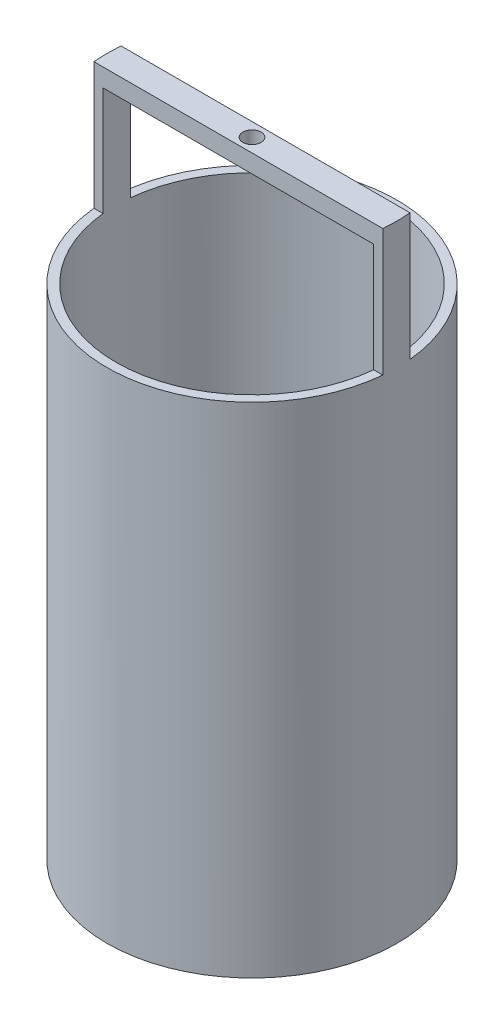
from build123d import *
from build123d.topology import SkipClean

# Parameters (mm, degrees)
SKETCH1_R           = 160
SKETCH1_R_2         = 150
BOSS_EXTRUDE1_DEPTH = 550
BOSS_EXTRUDE2_DEPTH = 120
SKETCH3_R           = 10
BOSS_EXTRUDE3_DEPTH = 20
SKETCH4_R           = 10
BOSS_EXTRUDE4_DEPTH = 20


with BuildPart() as part:
    # Sketch1 → Boss-Extrude1 (new body)
    with BuildSketch(Plane(origin=(0, 0, 0), x_dir=(1, 0, 0), z_dir=(0, 1, 0))):
        with Locations(Location((0, 0, 0), (0, 0, 270))):
            Circle(SKETCH1_R)
        with Locations(Location((0, 0, 0), (0, 0, 270))):
            Circle(SKETCH1_R_2, mode=Mode.SUBTRACT)
    extrude(amount=BOSS_EXTRUDE1_DEPTH)

    # Sketch2 → Boss-Extrude2 (add)
    with SkipClean():  # the faces are left unmerged after this step: merging them gives an invalid solid
        with BuildSketch(Plane(origin=(0, 550, 0), x_dir=(1, 0, 0), z_dir=(0, 1, 0))):
            with BuildLine():
                Line((-159.295323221, 15), (-149.248115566, 15))
                ThreePointArc((-149.248115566, 15), (-150, 0), (-149.248115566, -15))
                Line((-149.248115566, -15), (-159.295323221, -15))
                ThreePointArc((-159.295323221, -15), (-160, 0), (-159.295323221, 15))
            make_face()
            with BuildLine():
                Line((149.248115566, 15), (159.295323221, 15))
                ThreePointArc((159.295323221, 15), (160, 0), (159.295323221, -15))
                Line((159.295323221, -15), (149.248115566, -15))
                ThreePointArc((149.248115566, -15), (150, 0), (149.248115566, 15))
            make_face()
        extrude(amount=BOSS_EXTRUDE2_DEPTH)

    # Sketch3 → Boss-Extrude3 (add)
    with SkipClean():  # the faces are left unmerged after this step: merging them gives an invalid solid
        with BuildSketch(Plane(origin=(0, 670, 0), x_dir=(1, 0, 0), z_dir=(0, 1, 0))):
            with BuildLine():
                Line((-159.295323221, 15), (159.295323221, 15))
                ThreePointArc((159.295323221, 15), (160, 0), (159.295323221, -15))
                Line((159.295323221, -15), (-159.295323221, -15))
                ThreePointArc((-159.295323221, -15), (-160, 0), (-159.295323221, 15))
            make_face()
            with Locations(Location((0, 0, 0), (0, 0, 270))):
                Circle(SKETCH3_R, mode=Mode.SUBTRACT)
        extrude(amount=BOSS_EXTRUDE3_DEPTH)

    # Sketch4 → Boss-Extrude4 (add, symmetric)
    with SkipClean():  # the faces are left unmerged after this step: merging them gives an invalid solid
        with BuildSketch(Plane(origin=(0, 0, 0), x_dir=(0, 0, -1), z_dir=(1, 0, 0))):
            with BuildLine():
                Line((180, 40), (150, 40))
                Line((150, 40), (150, 0))
                Line((150, 0), (180, 0))
                ThreePointArc((180, 0), (200, 20), (180, 40))
            make_face()
            with Locations((180, 20)):
                Circle(SKETCH4_R, mode=Mode.SUBTRACT)
        extrude(amount=BOSS_EXTRUDE4_DEPTH, both=True)


solid = part.part
